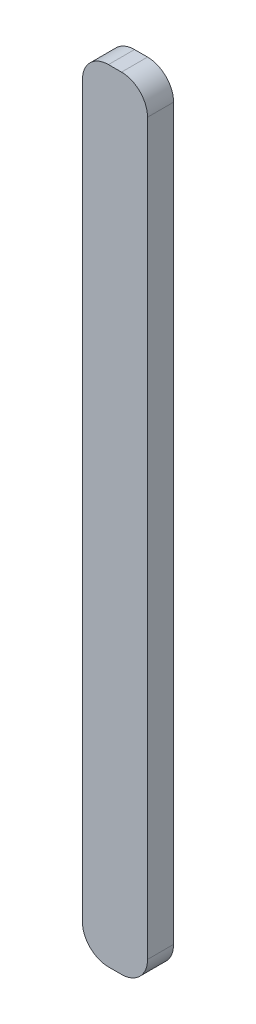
from build123d import *

# Parameters (mm, degrees)
SALIENTE_EXTRUIR1_DEPTH = 10


with BuildPart() as part:
    # Croquis1 → Saliente-Extruir1 (new body)
    with BuildSketch(Plane.XY):
        with BuildLine():
            Line((-2.5, 150), (2.5, 150))
            ThreePointArc((2.5, 150), (9.571067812, 147.071067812), (12.5, 140))
            Line((12.5, 140), (12.5, -140))
            ThreePointArc((12.5, -140), (9.571067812, -147.071067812), (2.5, -150))
            Line((2.5, -150), (-2.5, -150))
            ThreePointArc((-2.5, -150), (-9.571067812, -147.071067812), (-12.5, -140))
            Line((-12.5, -140), (-12.5, 140))
            ThreePointArc((-12.5, 140), (-9.571067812, 147.071067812), (-2.5, 150))
        make_face()
    extrude(amount=SALIENTE_EXTRUIR1_DEPTH)


solid = part.part
